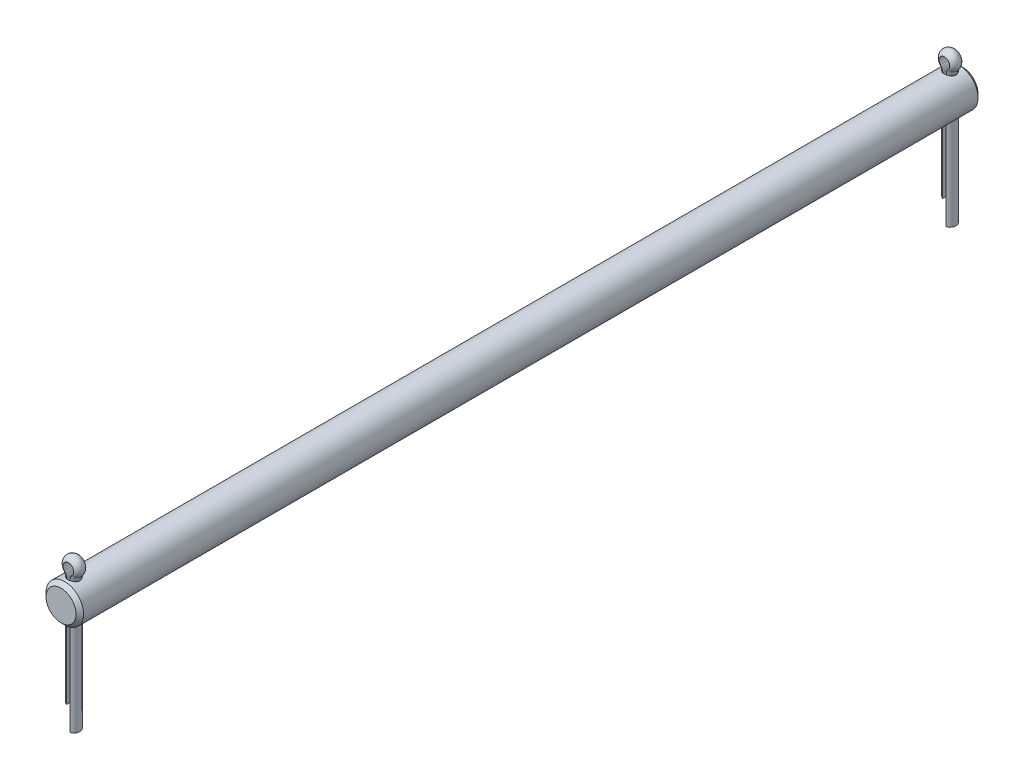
ISO-10303-21;
HEADER;
FILE_DESCRIPTION(('STEP AP214'),'2;1');
FILE_NAME('part.step','',(''),(''),'','','');
FILE_SCHEMA(('AUTOMOTIVE_DESIGN { 1 0 10303 214 1 1 1 1 }'));
ENDSEC;
DATA;
#1=APPLICATION_CONTEXT('core data for automotive mechanical design processes');
#2=APPLICATION_PROTOCOL_DEFINITION('international standard','automotive_design',2000,#1);
#3=PRODUCT_CONTEXT('',#1,'mechanical');
#4=PRODUCT('Part','Part','',(#3));
#5=PRODUCT_RELATED_PRODUCT_CATEGORY('part','',(#4));
#6=PRODUCT_DEFINITION_FORMATION('','',#4);
#7=PRODUCT_DEFINITION_CONTEXT('part definition',#1,'design');
#8=PRODUCT_DEFINITION('design','',#6,#7);
#9=PRODUCT_DEFINITION_SHAPE('','',#8);
#10=(LENGTH_UNIT() NAMED_UNIT(*) SI_UNIT(.MILLI.,.METRE.));
#11=(NAMED_UNIT(*) PLANE_ANGLE_UNIT() SI_UNIT($,.RADIAN.));
#12=(NAMED_UNIT(*) SI_UNIT($,.STERADIAN.) SOLID_ANGLE_UNIT());
#13=UNCERTAINTY_MEASURE_WITH_UNIT(LENGTH_MEASURE(1.E-05),#10,'distance_accuracy_value','');
#14=(GEOMETRIC_REPRESENTATION_CONTEXT(3) GLOBAL_UNCERTAINTY_ASSIGNED_CONTEXT((#13)) GLOBAL_UNIT_ASSIGNED_CONTEXT((#10,
#11,#12)) REPRESENTATION_CONTEXT('',''));
#15=CARTESIAN_POINT('',(0.,0.,0.));
#16=DIRECTION('',(0.,0.,1.));
#17=DIRECTION('',(1.,0.,0.));
#18=AXIS2_PLACEMENT_3D('',#15,#16,#17);
#19=CARTESIAN_POINT('',(-0.595312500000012,6.34999999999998,-149.927348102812));
#20=DIRECTION('',(1.,0.,0.));
#21=DIRECTION('',(0.,0.,1.));
#22=AXIS2_PLACEMENT_3D('',#19,#20,#21);
#23=PLANE('',#22);
#24=DIRECTION('',(0.,0.,-1.));
#25=VECTOR('',#24,1.);
#26=CARTESIAN_POINT('',(-0.595312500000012,6.34999999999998,-149.927348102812));
#27=LINE('',#26,#25);
#28=CARTESIAN_POINT('',(-0.595312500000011,6.34999999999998,-146.141401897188));
#29=VERTEX_POINT('',#28);
#30=CARTESIAN_POINT('',(-0.595312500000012,6.34999999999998,-149.927348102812));
#31=VERTEX_POINT('',#30);
#32=EDGE_CURVE('E157',#29,#31,#27,.T.);
#33=ORIENTED_EDGE('',*,*,#32,.F.);
#34=DIRECTION('',(0.,-1.,0.));
#35=VECTOR('',#34,1.);
#36=CARTESIAN_POINT('',(-0.595312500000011,6.34999999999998,-146.141401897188));
#37=LINE('',#36,#35);
#38=CARTESIAN_POINT('',(-0.595312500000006,-30.5049023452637,-146.141401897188));
#39=VERTEX_POINT('',#38);
#40=EDGE_CURVE('E12',#29,#39,#37,.T.);
#41=ORIENTED_EDGE('',*,*,#40,.T.);
#42=DIRECTION('',(0.,0.,-1.));
#43=VECTOR('',#42,1.);
#44=CARTESIAN_POINT('',(-0.595312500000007,-30.5049023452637,-149.927348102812));
#45=LINE('',#44,#43);
#46=CARTESIAN_POINT('',(-0.595312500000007,-30.5049023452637,-149.927348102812));
#47=VERTEX_POINT('',#46);
#48=EDGE_CURVE('E170',#39,#47,#45,.T.);
#49=ORIENTED_EDGE('',*,*,#48,.T.);
#50=DIRECTION('',(0.,-1.,0.));
#51=VECTOR('',#50,1.);
#52=CARTESIAN_POINT('',(-0.595312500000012,6.34999999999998,-149.927348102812));
#53=LINE('',#52,#51);
#54=EDGE_CURVE('E62',#31,#47,#53,.T.);
#55=ORIENTED_EDGE('',*,*,#54,.F.);
#56=EDGE_LOOP('',(#33,#41,#49,#55));
#57=FACE_BOUND('',#56,.T.);
#58=ADVANCED_FACE('F57',(#57),#23,.T.);
#59=CARTESIAN_POINT('',(0.,6.34999999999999,-148.034375));
#60=DIRECTION('',(0.,-1.,0.));
#61=DIRECTION('',(1.,0.,0.));
#62=AXIS2_PLACEMENT_3D('',#59,#60,#61);
#63=CYLINDRICAL_SURFACE('',#62,1.98437499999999);
#64=CARTESIAN_POINT('',(0.,6.34999999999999,-148.034375));
#65=DIRECTION('',(0.,1.,0.));
#66=DIRECTION('',(1.,0.,0.));
#67=AXIS2_PLACEMENT_3D('',#64,#65,#66);
#68=CIRCLE('',#67,1.98437499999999);
#69=EDGE_CURVE('E156',#31,#29,#68,.T.);
#70=ORIENTED_EDGE('',*,*,#69,.F.);
#71=ORIENTED_EDGE('',*,*,#54,.T.);
#72=CARTESIAN_POINT('',(0.,-30.5049023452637,-148.034375));
#73=DIRECTION('',(0.,1.,0.));
#74=DIRECTION('',(1.,0.,0.));
#75=AXIS2_PLACEMENT_3D('',#72,#73,#74);
#76=CIRCLE('',#75,1.98437499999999);
#77=EDGE_CURVE('E70',#47,#39,#76,.T.);
#78=ORIENTED_EDGE('',*,*,#77,.T.);
#79=ORIENTED_EDGE('',*,*,#40,.F.);
#80=EDGE_LOOP('',(#70,#71,#78,#79));
#81=FACE_BOUND('',#80,.T.);
#82=ADVANCED_FACE('F171',(#81),#63,.T.);
#83=CARTESIAN_POINT('',(-3.571875,6.35,-148.034375));
#84=DIRECTION('',(0.,0.,1.));
#85=DIRECTION('',(-1.,0.,0.));
#86=AXIS2_PLACEMENT_3D('',#83,#84,#85);
#87=CYLINDRICAL_SURFACE('',#86,2.97656249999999);
#88=DIRECTION('',(0.,0.,-1.));
#89=VECTOR('',#88,1.);
#90=CARTESIAN_POINT('',(-1.33945312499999,8.31881103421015,-149.927348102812));
#91=LINE('',#90,#89);
#92=CARTESIAN_POINT('',(-1.33945312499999,8.31881103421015,-146.141401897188));
#93=VERTEX_POINT('',#92);
#94=CARTESIAN_POINT('',(-1.33945312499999,8.31881103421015,-149.927348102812));
#95=VERTEX_POINT('',#94);
#96=EDGE_CURVE('E149',#93,#95,#91,.T.);
#97=ORIENTED_EDGE('',*,*,#96,.F.);
#98=CARTESIAN_POINT('',(-3.571875,6.35,-146.141401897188));
#99=DIRECTION('',(0.,0.,-1.));
#100=DIRECTION('',(-1.,0.,0.));
#101=AXIS2_PLACEMENT_3D('',#98,#99,#100);
#102=CIRCLE('',#101,2.97656249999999);
#103=EDGE_CURVE('E163',#93,#29,#102,.T.);
#104=ORIENTED_EDGE('',*,*,#103,.T.);
#105=ORIENTED_EDGE('',*,*,#32,.T.);
#106=CARTESIAN_POINT('',(-3.571875,6.35,-149.927348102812));
#107=DIRECTION('',(0.,0.,-1.));
#108=DIRECTION('',(-1.,0.,0.));
#109=AXIS2_PLACEMENT_3D('',#106,#107,#108);
#110=CIRCLE('',#109,2.97656249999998);
#111=EDGE_CURVE('E165',#95,#31,#110,.T.);
#112=ORIENTED_EDGE('',*,*,#111,.F.);
#113=EDGE_LOOP('',(#97,#104,#105,#112));
#114=FACE_BOUND('',#113,.T.);
#115=ADVANCED_FACE('F188',(#114),#87,.T.);
#116=CARTESIAN_POINT('',(-3.571875,6.35,-148.034375));
#117=DIRECTION('',(0.,0.,1.));
#118=DIRECTION('',(-1.,0.,0.));
#119=AXIS2_PLACEMENT_3D('',#116,#117,#118);
#120=TOROIDAL_SURFACE('',#119,3.57187499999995,1.98437499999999);
#121=CARTESIAN_POINT('',(-0.892968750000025,8.71257324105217,-148.034375));
#122=DIRECTION('',(-0.66143782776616,0.749999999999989,0.));
#123=DIRECTION('',(0.749999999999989,0.66143782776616,0.));
#124=AXIS2_PLACEMENT_3D('',#121,#122,#123);
#125=CIRCLE('',#124,1.98437499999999);
#126=EDGE_CURVE('E132',#95,#93,#125,.T.);
#127=ORIENTED_EDGE('',*,*,#126,.F.);
#128=ORIENTED_EDGE('',*,*,#111,.T.);
#129=ORIENTED_EDGE('',*,*,#69,.T.);
#130=ORIENTED_EDGE('',*,*,#103,.F.);
#131=EDGE_LOOP('',(#127,#128,#129,#130));
#132=FACE_BOUND('',#131,.T.);
#133=ADVANCED_FACE('F194',(#132),#120,.T.);
#134=CARTESIAN_POINT('',(0.,9.50009765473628,-148.034375));
#135=DIRECTION('',(0.,0.,-1.));
#136=DIRECTION('',(1.,0.,0.));
#137=AXIS2_PLACEMENT_3D('',#134,#135,#136);
#138=CYLINDRICAL_SURFACE('',#137,1.78593750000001);
#139=DIRECTION('',(0.,0.,-1.));
#140=VECTOR('',#139,1.);
#141=CARTESIAN_POINT('',(1.33945312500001,8.31881103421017,-149.927348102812));
#142=LINE('',#141,#140);
#143=CARTESIAN_POINT('',(1.33945312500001,8.31881103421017,-146.141401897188));
#144=VERTEX_POINT('',#143);
#145=CARTESIAN_POINT('',(1.33945312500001,8.31881103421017,-149.927348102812));
#146=VERTEX_POINT('',#145);
#147=EDGE_CURVE('E145',#144,#146,#142,.T.);
#148=ORIENTED_EDGE('',*,*,#147,.F.);
#149=CARTESIAN_POINT('',(0.,9.50009765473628,-146.141401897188));
#150=DIRECTION('',(0.,0.,1.));
#151=DIRECTION('',(1.,0.,0.));
#152=AXIS2_PLACEMENT_3D('',#149,#150,#151);
#153=CIRCLE('',#152,1.78593750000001);
#154=EDGE_CURVE('E152',#144,#93,#153,.T.);
#155=ORIENTED_EDGE('',*,*,#154,.T.);
#156=ORIENTED_EDGE('',*,*,#96,.T.);
#157=CARTESIAN_POINT('',(0.,9.50009765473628,-149.927348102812));
#158=DIRECTION('',(0.,0.,1.));
#159=DIRECTION('',(1.,0.,0.));
#160=AXIS2_PLACEMENT_3D('',#157,#158,#159);
#161=CIRCLE('',#160,1.78593750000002);
#162=EDGE_CURVE('E155',#146,#95,#161,.T.);
#163=ORIENTED_EDGE('',*,*,#162,.F.);
#164=EDGE_LOOP('',(#148,#155,#156,#163));
#165=FACE_BOUND('',#164,.T.);
#166=ADVANCED_FACE('F200',(#165),#138,.F.);
#167=CARTESIAN_POINT('',(0.,9.50009765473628,-148.034375));
#168=DIRECTION('',(0.,0.,-1.));
#169=DIRECTION('',(1.,0.,0.));
#170=AXIS2_PLACEMENT_3D('',#167,#168,#169);
#171=DEGENERATE_TOROIDAL_SURFACE('',#170,1.19062500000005,1.98437499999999,.T.);
#172=CARTESIAN_POINT('',(0.892968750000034,8.71257324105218,-148.034375));
#173=DIRECTION('',(-0.661437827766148,-0.75,0.));
#174=DIRECTION('',(-0.75,0.661437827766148,0.));
#175=AXIS2_PLACEMENT_3D('',#172,#173,#174);
#176=CIRCLE('',#175,1.98437499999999);
#177=EDGE_CURVE('E116',#146,#144,#176,.T.);
#178=ORIENTED_EDGE('',*,*,#177,.F.);
#179=ORIENTED_EDGE('',*,*,#162,.T.);
#180=ORIENTED_EDGE('',*,*,#126,.T.);
#181=ORIENTED_EDGE('',*,*,#154,.F.);
#182=EDGE_LOOP('',(#178,#179,#180,#181));
#183=FACE_BOUND('',#182,.T.);
#184=ADVANCED_FACE('F201',(#183),#171,.T.);
#185=CARTESIAN_POINT('',(3.571875,6.35,-148.034375));
#186=DIRECTION('',(0.,0.,1.));
#187=DIRECTION('',(-1.,0.,0.));
#188=AXIS2_PLACEMENT_3D('',#185,#186,#187);
#189=CYLINDRICAL_SURFACE('',#188,2.97656249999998);
#190=DIRECTION('',(0.,0.,-1.));
#191=VECTOR('',#190,1.);
#192=CARTESIAN_POINT('',(0.595312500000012,6.35,-149.927348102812));
#193=LINE('',#192,#191);
#194=CARTESIAN_POINT('',(0.595312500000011,6.35,-146.141401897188));
#195=VERTEX_POINT('',#194);
#196=CARTESIAN_POINT('',(0.595312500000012,6.35,-149.927348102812));
#197=VERTEX_POINT('',#196);
#198=EDGE_CURVE('E112',#195,#197,#193,.T.);
#199=ORIENTED_EDGE('',*,*,#198,.F.);
#200=CARTESIAN_POINT('',(3.571875,6.35,-146.141401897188));
#201=DIRECTION('',(0.,0.,-1.));
#202=DIRECTION('',(-1.,0.,0.));
#203=AXIS2_PLACEMENT_3D('',#200,#201,#202);
#204=CIRCLE('',#203,2.97656249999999);
#205=EDGE_CURVE('E130',#195,#144,#204,.T.);
#206=ORIENTED_EDGE('',*,*,#205,.T.);
#207=ORIENTED_EDGE('',*,*,#147,.T.);
#208=CARTESIAN_POINT('',(3.571875,6.35,-149.927348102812));
#209=DIRECTION('',(0.,0.,-1.));
#210=DIRECTION('',(-1.,0.,0.));
#211=AXIS2_PLACEMENT_3D('',#208,#209,#210);
#212=CIRCLE('',#211,2.97656249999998);
#213=EDGE_CURVE('E133',#197,#146,#212,.T.);
#214=ORIENTED_EDGE('',*,*,#213,.F.);
#215=EDGE_LOOP('',(#199,#206,#207,#214));
#216=FACE_BOUND('',#215,.T.);
#217=ADVANCED_FACE('F136',(#216),#189,.T.);
#218=CARTESIAN_POINT('',(3.571875,6.35,-148.034375));
#219=DIRECTION('',(0.,0.,1.));
#220=DIRECTION('',(-1.,0.,0.));
#221=AXIS2_PLACEMENT_3D('',#218,#219,#220);
#222=TOROIDAL_SURFACE('',#221,3.57187499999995,1.98437499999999);
#223=CARTESIAN_POINT('',(0.,6.35,-148.034375));
#224=DIRECTION('',(0.,-1.,0.));
#225=DIRECTION('',(-1.,0.,0.));
#226=AXIS2_PLACEMENT_3D('',#223,#224,#225);
#227=CIRCLE('',#226,1.98437499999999);
#228=EDGE_CURVE('E119',#197,#195,#227,.T.);
#229=ORIENTED_EDGE('',*,*,#228,.F.);
#230=ORIENTED_EDGE('',*,*,#213,.T.);
#231=ORIENTED_EDGE('',*,*,#177,.T.);
#232=ORIENTED_EDGE('',*,*,#205,.F.);
#233=EDGE_LOOP('',(#229,#230,#231,#232));
#234=FACE_BOUND('',#233,.T.);
#235=ADVANCED_FACE('F126',(#234),#222,.T.);
#236=CARTESIAN_POINT('',(0.,6.35,-148.034375));
#237=DIRECTION('',(0.,-1.,0.));
#238=DIRECTION('',(1.,0.,0.));
#239=AXIS2_PLACEMENT_3D('',#236,#237,#238);
#240=CYLINDRICAL_SURFACE('',#239,1.98437499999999);
#241=CARTESIAN_POINT('',(0.,-38.1249023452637,-148.034375));
#242=DIRECTION('',(0.,-1.,0.));
#243=DIRECTION('',(-1.,0.,0.));
#244=AXIS2_PLACEMENT_3D('',#241,#242,#243);
#245=CIRCLE('',#244,1.98437499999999);
#246=CARTESIAN_POINT('',(0.595312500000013,-38.1249023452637,-149.927348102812));
#247=VERTEX_POINT('',#246);
#248=CARTESIAN_POINT('',(0.595312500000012,-38.1249023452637,-146.141401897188));
#249=VERTEX_POINT('',#248);
#250=EDGE_CURVE('E140',#247,#249,#245,.T.);
#251=ORIENTED_EDGE('',*,*,#250,.F.);
#252=DIRECTION('',(0.,-1.,0.));
#253=VECTOR('',#252,1.);
#254=CARTESIAN_POINT('',(0.595312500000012,6.35,-149.927348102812));
#255=LINE('',#254,#253);
#256=EDGE_CURVE('E120',#197,#247,#255,.T.);
#257=ORIENTED_EDGE('',*,*,#256,.F.);
#258=ORIENTED_EDGE('',*,*,#228,.T.);
#259=DIRECTION('',(0.,-1.,0.));
#260=VECTOR('',#259,1.);
#261=CARTESIAN_POINT('',(0.595312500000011,6.35,-146.141401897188));
#262=LINE('',#261,#260);
#263=EDGE_CURVE('E106',#195,#249,#262,.T.);
#264=ORIENTED_EDGE('',*,*,#263,.T.);
#265=EDGE_LOOP('',(#251,#257,#258,#264));
#266=FACE_BOUND('',#265,.T.);
#267=ADVANCED_FACE('F122',(#266),#240,.T.);
#268=CARTESIAN_POINT('',(0.595312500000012,6.35,-149.927348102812));
#269=DIRECTION('',(1.,0.,0.));
#270=DIRECTION('',(0.,0.,1.));
#271=AXIS2_PLACEMENT_3D('',#268,#269,#270);
#272=PLANE('',#271);
#273=DIRECTION('',(0.,0.,-1.));
#274=VECTOR('',#273,1.);
#275=CARTESIAN_POINT('',(0.595312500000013,-38.1249023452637,-149.927348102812));
#276=LINE('',#275,#274);
#277=EDGE_CURVE('E115',#249,#247,#276,.T.);
#278=ORIENTED_EDGE('',*,*,#277,.F.);
#279=ORIENTED_EDGE('',*,*,#263,.F.);
#280=ORIENTED_EDGE('',*,*,#198,.T.);
#281=ORIENTED_EDGE('',*,*,#256,.T.);
#282=EDGE_LOOP('',(#278,#279,#280,#281));
#283=FACE_BOUND('',#282,.T.);
#284=ADVANCED_FACE('F107',(#283),#272,.F.);
#285=CARTESIAN_POINT('',(0.,-30.5049023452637,-148.034375));
#286=DIRECTION('',(0.,-1.,0.));
#287=DIRECTION('',(1.,0.,0.));
#288=AXIS2_PLACEMENT_3D('',#285,#286,#287);
#289=PLANE('',#288);
#290=ORIENTED_EDGE('',*,*,#77,.F.);
#291=ORIENTED_EDGE('',*,*,#48,.F.);
#292=EDGE_LOOP('',(#290,#291));
#293=FACE_BOUND('',#292,.T.);
#294=ADVANCED_FACE('F173',(#293),#289,.T.);
#295=CARTESIAN_POINT('',(0.,-38.1249023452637,-148.034375));
#296=DIRECTION('',(0.,1.,0.));
#297=DIRECTION('',(-1.,0.,0.));
#298=AXIS2_PLACEMENT_3D('',#295,#296,#297);
#299=PLANE('',#298);
#300=ORIENTED_EDGE('',*,*,#250,.T.);
#301=ORIENTED_EDGE('',*,*,#277,.T.);
#302=EDGE_LOOP('',(#300,#301));
#303=FACE_BOUND('',#302,.T.);
#304=ADVANCED_FACE('F176',(#303),#299,.F.);
#305=CLOSED_SHELL('',(#58,#82,#115,#133,#166,#184,#217,#235,#267,#284,#294,#304));
#306=MANIFOLD_SOLID_BREP('B2',#305);
#307=CARTESIAN_POINT('',(-0.595312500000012,6.34999999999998,149.927348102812));
#308=DIRECTION('',(1.,0.,0.));
#309=DIRECTION('',(0.,0.,-1.));
#310=AXIS2_PLACEMENT_3D('',#307,#308,#309);
#311=PLANE('',#310);
#312=DIRECTION('',(0.,0.,1.));
#313=VECTOR('',#312,1.);
#314=CARTESIAN_POINT('',(-0.595312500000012,6.34999999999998,149.927348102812));
#315=LINE('',#314,#313);
#316=CARTESIAN_POINT('',(-0.595312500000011,6.34999999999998,146.141401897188));
#317=VERTEX_POINT('',#316);
#318=CARTESIAN_POINT('',(-0.595312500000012,6.34999999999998,149.927348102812));
#319=VERTEX_POINT('',#318);
#320=EDGE_CURVE('E405',#317,#319,#315,.T.);
#321=ORIENTED_EDGE('',*,*,#320,.T.);
#322=DIRECTION('',(0.,-1.,0.));
#323=VECTOR('',#322,1.);
#324=CARTESIAN_POINT('',(-0.595312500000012,6.34999999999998,149.927348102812));
#325=LINE('',#324,#323);
#326=CARTESIAN_POINT('',(-0.595312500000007,-30.5049023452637,149.927348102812));
#327=VERTEX_POINT('',#326);
#328=EDGE_CURVE('E302',#319,#327,#325,.T.);
#329=ORIENTED_EDGE('',*,*,#328,.T.);
#330=DIRECTION('',(0.,0.,1.));
#331=VECTOR('',#330,1.);
#332=CARTESIAN_POINT('',(-0.595312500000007,-30.5049023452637,149.927348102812));
#333=LINE('',#332,#331);
#334=CARTESIAN_POINT('',(-0.595312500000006,-30.5049023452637,146.141401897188));
#335=VERTEX_POINT('',#334);
#336=EDGE_CURVE('E310',#335,#327,#333,.T.);
#337=ORIENTED_EDGE('',*,*,#336,.F.);
#338=DIRECTION('',(0.,-1.,0.));
#339=VECTOR('',#338,1.);
#340=CARTESIAN_POINT('',(-0.595312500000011,6.34999999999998,146.141401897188));
#341=LINE('',#340,#339);
#342=EDGE_CURVE('E53',#317,#335,#341,.T.);
#343=ORIENTED_EDGE('',*,*,#342,.F.);
#344=EDGE_LOOP('',(#321,#329,#337,#343));
#345=FACE_BOUND('',#344,.T.);
#346=ADVANCED_FACE('F293',(#345),#311,.T.);
#347=CARTESIAN_POINT('',(0.,6.34999999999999,148.034375));
#348=DIRECTION('',(0.,-1.,0.));
#349=DIRECTION('',(1.,0.,0.));
#350=AXIS2_PLACEMENT_3D('',#347,#348,#349);
#351=CYLINDRICAL_SURFACE('',#350,1.98437499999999);
#352=CARTESIAN_POINT('',(0.,6.34999999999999,148.034375));
#353=DIRECTION('',(0.,-1.,0.));
#354=DIRECTION('',(1.,0.,0.));
#355=AXIS2_PLACEMENT_3D('',#352,#353,#354);
#356=CIRCLE('',#355,1.98437499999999);
#357=EDGE_CURVE('E398',#319,#317,#356,.T.);
#358=ORIENTED_EDGE('',*,*,#357,.T.);
#359=ORIENTED_EDGE('',*,*,#342,.T.);
#360=CARTESIAN_POINT('',(0.,-30.5049023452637,148.034375));
#361=DIRECTION('',(0.,-1.,0.));
#362=DIRECTION('',(1.,0.,0.));
#363=AXIS2_PLACEMENT_3D('',#360,#361,#362);
#364=CIRCLE('',#363,1.98437499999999);
#365=EDGE_CURVE('E312',#327,#335,#364,.T.);
#366=ORIENTED_EDGE('',*,*,#365,.F.);
#367=ORIENTED_EDGE('',*,*,#328,.F.);
#368=EDGE_LOOP('',(#358,#359,#366,#367));
#369=FACE_BOUND('',#368,.T.);
#370=ADVANCED_FACE('F413',(#369),#351,.T.);
#371=CARTESIAN_POINT('',(-3.571875,6.35,148.034375));
#372=DIRECTION('',(0.,0.,-1.));
#373=DIRECTION('',(-1.,0.,0.));
#374=AXIS2_PLACEMENT_3D('',#371,#372,#373);
#375=CYLINDRICAL_SURFACE('',#374,2.97656249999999);
#376=DIRECTION('',(0.,0.,1.));
#377=VECTOR('',#376,1.);
#378=CARTESIAN_POINT('',(-1.33945312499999,8.31881103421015,149.927348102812));
#379=LINE('',#378,#377);
#380=CARTESIAN_POINT('',(-1.33945312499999,8.31881103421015,146.141401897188));
#381=VERTEX_POINT('',#380);
#382=CARTESIAN_POINT('',(-1.33945312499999,8.31881103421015,149.927348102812));
#383=VERTEX_POINT('',#382);
#384=EDGE_CURVE('E388',#381,#383,#379,.T.);
#385=ORIENTED_EDGE('',*,*,#384,.T.);
#386=CARTESIAN_POINT('',(-3.571875,6.35,149.927348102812));
#387=DIRECTION('',(0.,0.,-1.));
#388=DIRECTION('',(-1.,0.,0.));
#389=AXIS2_PLACEMENT_3D('',#386,#387,#388);
#390=CIRCLE('',#389,2.97656249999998);
#391=EDGE_CURVE('E403',#383,#319,#390,.T.);
#392=ORIENTED_EDGE('',*,*,#391,.T.);
#393=ORIENTED_EDGE('',*,*,#320,.F.);
#394=CARTESIAN_POINT('',(-3.571875,6.35,146.141401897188));
#395=DIRECTION('',(0.,0.,-1.));
#396=DIRECTION('',(-1.,0.,0.));
#397=AXIS2_PLACEMENT_3D('',#394,#395,#396);
#398=CIRCLE('',#397,2.97656249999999);
#399=EDGE_CURVE('E407',#381,#317,#398,.T.);
#400=ORIENTED_EDGE('',*,*,#399,.F.);
#401=EDGE_LOOP('',(#385,#392,#393,#400));
#402=FACE_BOUND('',#401,.T.);
#403=ADVANCED_FACE('F417',(#402),#375,.T.);
#404=CARTESIAN_POINT('',(-3.571875,6.35,148.034375));
#405=DIRECTION('',(0.,0.,-1.));
#406=DIRECTION('',(-1.,0.,0.));
#407=AXIS2_PLACEMENT_3D('',#404,#405,#406);
#408=TOROIDAL_SURFACE('',#407,3.57187499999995,1.98437499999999);
#409=CARTESIAN_POINT('',(-0.892968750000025,8.71257324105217,148.034375));
#410=DIRECTION('',(0.66143782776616,-0.749999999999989,0.));
#411=DIRECTION('',(0.749999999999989,0.66143782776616,0.));
#412=AXIS2_PLACEMENT_3D('',#409,#410,#411);
#413=CIRCLE('',#412,1.98437499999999);
#414=EDGE_CURVE('E359',#383,#381,#413,.T.);
#415=ORIENTED_EDGE('',*,*,#414,.T.);
#416=ORIENTED_EDGE('',*,*,#399,.T.);
#417=ORIENTED_EDGE('',*,*,#357,.F.);
#418=ORIENTED_EDGE('',*,*,#391,.F.);
#419=EDGE_LOOP('',(#415,#416,#417,#418));
#420=FACE_BOUND('',#419,.T.);
#421=ADVANCED_FACE('F416',(#420),#408,.T.);
#422=CARTESIAN_POINT('',(0.,9.50009765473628,148.034375));
#423=DIRECTION('',(0.,0.,1.));
#424=DIRECTION('',(1.,0.,0.));
#425=AXIS2_PLACEMENT_3D('',#422,#423,#424);
#426=CYLINDRICAL_SURFACE('',#425,1.78593750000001);
#427=DIRECTION('',(0.,0.,1.));
#428=VECTOR('',#427,1.);
#429=CARTESIAN_POINT('',(1.33945312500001,8.31881103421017,149.927348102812));
#430=LINE('',#429,#428);
#431=CARTESIAN_POINT('',(1.33945312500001,8.31881103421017,146.141401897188));
#432=VERTEX_POINT('',#431);
#433=CARTESIAN_POINT('',(1.33945312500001,8.31881103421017,149.927348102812));
#434=VERTEX_POINT('',#433);
#435=EDGE_CURVE('E354',#432,#434,#430,.T.);
#436=ORIENTED_EDGE('',*,*,#435,.T.);
#437=CARTESIAN_POINT('',(0.,9.50009765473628,149.927348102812));
#438=DIRECTION('',(0.,0.,1.));
#439=DIRECTION('',(1.,0.,0.));
#440=AXIS2_PLACEMENT_3D('',#437,#438,#439);
#441=CIRCLE('',#440,1.78593750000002);
#442=EDGE_CURVE('E392',#434,#383,#441,.T.);
#443=ORIENTED_EDGE('',*,*,#442,.T.);
#444=ORIENTED_EDGE('',*,*,#384,.F.);
#445=CARTESIAN_POINT('',(0.,9.50009765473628,146.141401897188));
#446=DIRECTION('',(0.,0.,1.));
#447=DIRECTION('',(1.,0.,0.));
#448=AXIS2_PLACEMENT_3D('',#445,#446,#447);
#449=CIRCLE('',#448,1.78593750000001);
#450=EDGE_CURVE('E396',#432,#381,#449,.T.);
#451=ORIENTED_EDGE('',*,*,#450,.F.);
#452=EDGE_LOOP('',(#436,#443,#444,#451));
#453=FACE_BOUND('',#452,.T.);
#454=ADVANCED_FACE('F421',(#453),#426,.F.);
#455=CARTESIAN_POINT('',(0.,9.50009765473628,148.034375));
#456=DIRECTION('',(0.,0.,1.));
#457=DIRECTION('',(1.,0.,0.));
#458=AXIS2_PLACEMENT_3D('',#455,#456,#457);
#459=DEGENERATE_TOROIDAL_SURFACE('',#458,1.19062500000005,1.98437499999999,.T.);
#460=CARTESIAN_POINT('',(0.892968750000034,8.71257324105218,148.034375));
#461=DIRECTION('',(0.661437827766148,0.75,0.));
#462=DIRECTION('',(-0.75,0.661437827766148,0.));
#463=AXIS2_PLACEMENT_3D('',#460,#461,#462);
#464=CIRCLE('',#463,1.98437499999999);
#465=EDGE_CURVE('E377',#434,#432,#464,.T.);
#466=ORIENTED_EDGE('',*,*,#465,.T.);
#467=ORIENTED_EDGE('',*,*,#450,.T.);
#468=ORIENTED_EDGE('',*,*,#414,.F.);
#469=ORIENTED_EDGE('',*,*,#442,.F.);
#470=EDGE_LOOP('',(#466,#467,#468,#469));
#471=FACE_BOUND('',#470,.T.);
#472=ADVANCED_FACE('F424',(#471),#459,.T.);
#473=CARTESIAN_POINT('',(3.571875,6.35,148.034375));
#474=DIRECTION('',(0.,0.,-1.));
#475=DIRECTION('',(-1.,0.,0.));
#476=AXIS2_PLACEMENT_3D('',#473,#474,#475);
#477=CYLINDRICAL_SURFACE('',#476,2.97656249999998);
#478=DIRECTION('',(0.,0.,1.));
#479=VECTOR('',#478,1.);
#480=CARTESIAN_POINT('',(0.595312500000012,6.35,149.927348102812));
#481=LINE('',#480,#479);
#482=CARTESIAN_POINT('',(0.595312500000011,6.35,146.141401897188));
#483=VERTEX_POINT('',#482);
#484=CARTESIAN_POINT('',(0.595312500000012,6.35,149.927348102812));
#485=VERTEX_POINT('',#484);
#486=EDGE_CURVE('E355',#483,#485,#481,.T.);
#487=ORIENTED_EDGE('',*,*,#486,.T.);
#488=CARTESIAN_POINT('',(3.571875,6.35,149.927348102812));
#489=DIRECTION('',(0.,0.,-1.));
#490=DIRECTION('',(-1.,0.,0.));
#491=AXIS2_PLACEMENT_3D('',#488,#489,#490);
#492=CIRCLE('',#491,2.97656249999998);
#493=EDGE_CURVE('E358',#485,#434,#492,.T.);
#494=ORIENTED_EDGE('',*,*,#493,.T.);
#495=ORIENTED_EDGE('',*,*,#435,.F.);
#496=CARTESIAN_POINT('',(3.571875,6.35,146.141401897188));
#497=DIRECTION('',(0.,0.,-1.));
#498=DIRECTION('',(-1.,0.,0.));
#499=AXIS2_PLACEMENT_3D('',#496,#497,#498);
#500=CIRCLE('',#499,2.97656249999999);
#501=EDGE_CURVE('E350',#483,#432,#500,.T.);
#502=ORIENTED_EDGE('',*,*,#501,.F.);
#503=EDGE_LOOP('',(#487,#494,#495,#502));
#504=FACE_BOUND('',#503,.T.);
#505=ADVANCED_FACE('F349',(#504),#477,.T.);
#506=CARTESIAN_POINT('',(3.571875,6.35,148.034375));
#507=DIRECTION('',(0.,0.,-1.));
#508=DIRECTION('',(-1.,0.,0.));
#509=AXIS2_PLACEMENT_3D('',#506,#507,#508);
#510=TOROIDAL_SURFACE('',#509,3.57187499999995,1.98437499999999);
#511=CARTESIAN_POINT('',(0.,6.35,148.034375));
#512=DIRECTION('',(0.,1.,0.));
#513=DIRECTION('',(-1.,0.,0.));
#514=AXIS2_PLACEMENT_3D('',#511,#512,#513);
#515=CIRCLE('',#514,1.98437499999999);
#516=EDGE_CURVE('E362',#485,#483,#515,.T.);
#517=ORIENTED_EDGE('',*,*,#516,.T.);
#518=ORIENTED_EDGE('',*,*,#501,.T.);
#519=ORIENTED_EDGE('',*,*,#465,.F.);
#520=ORIENTED_EDGE('',*,*,#493,.F.);
#521=EDGE_LOOP('',(#517,#518,#519,#520));
#522=FACE_BOUND('',#521,.T.);
#523=ADVANCED_FACE('F361',(#522),#510,.T.);
#524=CARTESIAN_POINT('',(0.,6.35,148.034375));
#525=DIRECTION('',(0.,-1.,0.));
#526=DIRECTION('',(1.,0.,0.));
#527=AXIS2_PLACEMENT_3D('',#524,#525,#526);
#528=CYLINDRICAL_SURFACE('',#527,1.98437499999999);
#529=CARTESIAN_POINT('',(0.,-38.1249023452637,148.034375));
#530=DIRECTION('',(0.,1.,0.));
#531=DIRECTION('',(-1.,0.,0.));
#532=AXIS2_PLACEMENT_3D('',#529,#530,#531);
#533=CIRCLE('',#532,1.98437499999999);
#534=CARTESIAN_POINT('',(0.595312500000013,-38.1249023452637,149.927348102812));
#535=VERTEX_POINT('',#534);
#536=CARTESIAN_POINT('',(0.595312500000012,-38.1249023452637,146.141401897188));
#537=VERTEX_POINT('',#536);
#538=EDGE_CURVE('E378',#535,#537,#533,.T.);
#539=ORIENTED_EDGE('',*,*,#538,.T.);
#540=DIRECTION('',(0.,-1.,0.));
#541=VECTOR('',#540,1.);
#542=CARTESIAN_POINT('',(0.595312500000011,6.35,146.141401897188));
#543=LINE('',#542,#541);
#544=EDGE_CURVE('E375',#483,#537,#543,.T.);
#545=ORIENTED_EDGE('',*,*,#544,.F.);
#546=ORIENTED_EDGE('',*,*,#516,.F.);
#547=DIRECTION('',(0.,-1.,0.));
#548=VECTOR('',#547,1.);
#549=CARTESIAN_POINT('',(0.595312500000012,6.35,149.927348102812));
#550=LINE('',#549,#548);
#551=EDGE_CURVE('E372',#485,#535,#550,.T.);
#552=ORIENTED_EDGE('',*,*,#551,.T.);
#553=EDGE_LOOP('',(#539,#545,#546,#552));
#554=FACE_BOUND('',#553,.T.);
#555=ADVANCED_FACE('F376',(#554),#528,.T.);
#556=CARTESIAN_POINT('',(0.595312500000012,6.35,149.927348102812));
#557=DIRECTION('',(1.,0.,0.));
#558=DIRECTION('',(0.,0.,-1.));
#559=AXIS2_PLACEMENT_3D('',#556,#557,#558);
#560=PLANE('',#559);
#561=DIRECTION('',(0.,0.,1.));
#562=VECTOR('',#561,1.);
#563=CARTESIAN_POINT('',(0.595312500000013,-38.1249023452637,149.927348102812));
#564=LINE('',#563,#562);
#565=EDGE_CURVE('E370',#537,#535,#564,.T.);
#566=ORIENTED_EDGE('',*,*,#565,.T.);
#567=ORIENTED_EDGE('',*,*,#551,.F.);
#568=ORIENTED_EDGE('',*,*,#486,.F.);
#569=ORIENTED_EDGE('',*,*,#544,.T.);
#570=EDGE_LOOP('',(#566,#567,#568,#569));
#571=FACE_BOUND('',#570,.T.);
#572=ADVANCED_FACE('F371',(#571),#560,.F.);
#573=CARTESIAN_POINT('',(0.,-30.5049023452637,148.034375));
#574=DIRECTION('',(0.,-1.,0.));
#575=DIRECTION('',(1.,0.,0.));
#576=AXIS2_PLACEMENT_3D('',#573,#574,#575);
#577=PLANE('',#576);
#578=ORIENTED_EDGE('',*,*,#365,.T.);
#579=ORIENTED_EDGE('',*,*,#336,.T.);
#580=EDGE_LOOP('',(#578,#579));
#581=FACE_BOUND('',#580,.T.);
#582=ADVANCED_FACE('F488',(#581),#577,.T.);
#583=CARTESIAN_POINT('',(0.,-38.1249023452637,148.034375));
#584=DIRECTION('',(0.,1.,0.));
#585=DIRECTION('',(-1.,0.,0.));
#586=AXIS2_PLACEMENT_3D('',#583,#584,#585);
#587=PLANE('',#586);
#588=ORIENTED_EDGE('',*,*,#538,.F.);
#589=ORIENTED_EDGE('',*,*,#565,.F.);
#590=EDGE_LOOP('',(#588,#589));
#591=FACE_BOUND('',#590,.T.);
#592=ADVANCED_FACE('F500',(#591),#587,.F.);
#593=CLOSED_SHELL('',(#346,#370,#403,#421,#454,#472,#505,#523,#555,#572,#582,#592));
#594=MANIFOLD_SOLID_BREP('B6',#593);
#595=CARTESIAN_POINT('',(0.,0.,152.4));
#596=DIRECTION('',(0.,0.,-1.));
#597=DIRECTION('',(-1.,0.,0.));
#598=AXIS2_PLACEMENT_3D('',#595,#596,#597);
#599=CYLINDRICAL_SURFACE('',#598,6.35);
#600=CARTESIAN_POINT('',(0.,0.,-151.13));
#601=DIRECTION('',(0.,0.,1.));
#602=DIRECTION('',(1.,0.,0.));
#603=AXIS2_PLACEMENT_3D('',#600,#601,#602);
#604=CIRCLE('',#603,6.35);
#605=CARTESIAN_POINT('',(6.35,0.,-151.13));
#606=VERTEX_POINT('',#605);
#607=EDGE_CURVE('E538',#606,#606,#604,.T.);
#608=ORIENTED_EDGE('',*,*,#607,.T.);
#609=EDGE_LOOP('',(#608));
#610=FACE_BOUND('',#609,.T.);
#611=CARTESIAN_POINT('',(0.,0.,151.13));
#612=DIRECTION('',(0.,0.,1.));
#613=DIRECTION('',(1.,0.,0.));
#614=AXIS2_PLACEMENT_3D('',#611,#612,#613);
#615=CIRCLE('',#614,6.35);
#616=CARTESIAN_POINT('',(6.35,0.,151.13));
#617=VERTEX_POINT('',#616);
#618=EDGE_CURVE('E545',#617,#617,#615,.F.);
#619=ORIENTED_EDGE('',*,*,#618,.T.);
#620=EDGE_LOOP('',(#619));
#621=FACE_BOUND('',#620,.T.);
#622=CARTESIAN_POINT('',(0.,-6.35,-146.05));
#623=CARTESIAN_POINT('',(0.10864720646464,-6.34999945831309,-146.050000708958));
#624=CARTESIAN_POINT('',(0.217301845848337,-6.34718528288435,-146.058952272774));
#625=CARTESIAN_POINT('',(0.431433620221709,-6.3362346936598,-146.094428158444));
#626=CARTESIAN_POINT('',(0.536910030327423,-6.32809707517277,-146.120956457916));
#627=CARTESIAN_POINT('',(0.741566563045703,-6.30738857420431,-146.190603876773));
#628=CARTESIAN_POINT('',(0.840756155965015,-6.29482455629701,-146.233697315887));
#629=CARTESIAN_POINT('',(1.03050149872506,-6.26656051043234,-146.335142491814));
#630=CARTESIAN_POINT('',(1.12105588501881,-6.25085998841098,-146.393496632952));
#631=CARTESIAN_POINT('',(1.29375746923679,-6.21744714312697,-146.525703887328));
#632=CARTESIAN_POINT('',(1.37560054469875,-6.19969099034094,-146.599943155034));
#633=CARTESIAN_POINT('',(1.52590084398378,-6.16442198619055,-146.760991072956));
#634=CARTESIAN_POINT('',(1.59435557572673,-6.14690918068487,-146.847802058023));
#635=CARTESIAN_POINT('',(1.71758509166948,-6.11363942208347,-147.034161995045));
#636=CARTESIAN_POINT('',(1.77197994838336,-6.09793656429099,-147.133972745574));
#637=CARTESIAN_POINT('',(1.86308588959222,-6.07072385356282,-147.341895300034));
#638=CARTESIAN_POINT('',(1.89980163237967,-6.05921289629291,-147.450004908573));
#639=CARTESIAN_POINT('',(1.95339430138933,-6.04214576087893,-147.668024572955));
#640=CARTESIAN_POINT('',(1.9708353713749,-6.03642069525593,-147.777782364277));
#641=CARTESIAN_POINT('',(1.98714606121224,-6.03107212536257,-147.998804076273));
#642=CARTESIAN_POINT('',(1.98602061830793,-6.03144699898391,-148.110067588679));
#643=CARTESIAN_POINT('',(1.96567146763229,-6.03810687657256,-148.326275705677));
#644=CARTESIAN_POINT('',(1.94716491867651,-6.04415767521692,-148.431296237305));
#645=CARTESIAN_POINT('',(1.89374166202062,-6.06110715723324,-148.636660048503));
#646=CARTESIAN_POINT('',(1.8588232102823,-6.07200635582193,-148.737002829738));
#647=CARTESIAN_POINT('',(1.77306088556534,-6.09760407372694,-148.931871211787));
#648=CARTESIAN_POINT('',(1.72199181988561,-6.11235576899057,-149.026290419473));
#649=CARTESIAN_POINT('',(1.6055343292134,-6.14397197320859,-149.205454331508));
#650=CARTESIAN_POINT('',(1.5401421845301,-6.16083703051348,-149.290196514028));
#651=CARTESIAN_POINT('',(1.39337566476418,-6.19571925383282,-149.451655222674));
#652=CARTESIAN_POINT('',(1.31140925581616,-6.21375391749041,-149.527830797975));
#653=CARTESIAN_POINT('',(1.13564099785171,-6.24826618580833,-149.665486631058));
#654=CARTESIAN_POINT('',(1.04183827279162,-6.26474367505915,-149.726965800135));
#655=CARTESIAN_POINT('',(0.844017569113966,-6.29445805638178,-149.833850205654));
#656=CARTESIAN_POINT('',(0.73992566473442,-6.30766868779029,-149.879126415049));
#657=CARTESIAN_POINT('',(0.525094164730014,-6.32917129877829,-149.951365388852));
#658=CARTESIAN_POINT('',(0.414356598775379,-6.33746477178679,-149.978333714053));
#659=CARTESIAN_POINT('',(0.193968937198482,-6.34795830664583,-150.012269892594));
#660=CARTESIAN_POINT('',(0.0844420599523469,-6.35038136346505,-150.019970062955));
#661=CARTESIAN_POINT('',(-0.134350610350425,-6.34952057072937,-150.017216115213));
#662=CARTESIAN_POINT('',(-0.24361643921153,-6.34623755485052,-150.006764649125));
#663=CARTESIAN_POINT('',(-0.455960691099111,-6.33448002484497,-149.968591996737));
#664=CARTESIAN_POINT('',(-0.559125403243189,-6.32613659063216,-149.941306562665));
#665=CARTESIAN_POINT('',(-0.759383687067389,-6.30523442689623,-149.870772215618));
#666=CARTESIAN_POINT('',(-0.856476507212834,-6.29267517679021,-149.82752133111));
#667=CARTESIAN_POINT('',(-1.04446769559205,-6.26425186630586,-149.725105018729));
#668=CARTESIAN_POINT('',(-1.13515733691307,-6.24831470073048,-149.665577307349));
#669=CARTESIAN_POINT('',(-1.30550578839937,-6.21495788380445,-149.532731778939));
#670=CARTESIAN_POINT('',(-1.38516159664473,-6.19753783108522,-149.45941022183));
#671=CARTESIAN_POINT('',(-1.5344575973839,-6.16230979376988,-149.297614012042));
#672=CARTESIAN_POINT('',(-1.60357585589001,-6.14451378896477,-149.208654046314));
#673=CARTESIAN_POINT('',(-1.72594984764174,-6.11127091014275,-149.020011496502));
#674=CARTESIAN_POINT('',(-1.77920583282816,-6.09582399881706,-148.920329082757));
#675=CARTESIAN_POINT('',(-1.86801257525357,-6.06919954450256,-148.713277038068));
#676=CARTESIAN_POINT('',(-1.90363188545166,-6.05800551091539,-148.605939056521));
#677=CARTESIAN_POINT('',(-1.95616344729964,-6.04124983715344,-148.386367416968));
#678=CARTESIAN_POINT('',(-1.97308281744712,-6.035686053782,-148.274135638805));
#679=CARTESIAN_POINT('',(-1.9872230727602,-6.03104414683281,-148.053418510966));
#680=CARTESIAN_POINT('',(-1.98530018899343,-6.03168409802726,-147.944993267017));
#681=CARTESIAN_POINT('',(-1.9638774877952,-6.03869268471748,-147.730091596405));
#682=CARTESIAN_POINT('',(-1.94437849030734,-6.04506105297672,-147.623615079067));
#683=CARTESIAN_POINT('',(-1.88893021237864,-6.06261192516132,-147.417164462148));
#684=CARTESIAN_POINT('',(-1.85322594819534,-6.07372258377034,-147.317117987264));
#685=CARTESIAN_POINT('',(-1.76657360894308,-6.09948780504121,-147.124355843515));
#686=CARTESIAN_POINT('',(-1.71562243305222,-6.11414308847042,-147.031641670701));
#687=CARTESIAN_POINT('',(-1.59759134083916,-6.14606160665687,-146.852249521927));
#688=CARTESIAN_POINT('',(-1.52995841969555,-6.16340443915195,-146.765949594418));
#689=CARTESIAN_POINT('',(-1.38145678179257,-6.19837785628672,-146.605646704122));
#690=CARTESIAN_POINT('',(-1.30058452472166,-6.21600851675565,-146.531647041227));
#691=CARTESIAN_POINT('',(-1.12472257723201,-6.25026169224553,-146.395626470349));
#692=CARTESIAN_POINT('',(-1.02935813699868,-6.26683248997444,-146.334075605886));
#693=CARTESIAN_POINT('',(-0.829118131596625,-6.29644996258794,-146.227960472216));
#694=CARTESIAN_POINT('',(-0.724246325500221,-6.30949802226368,-146.18338952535));
#695=CARTESIAN_POINT('',(-0.517124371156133,-6.32969033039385,-146.115736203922));
#696=CARTESIAN_POINT('',(-0.415401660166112,-6.3372403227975,-146.091156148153));
#697=CARTESIAN_POINT('',(-0.209121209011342,-6.34739491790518,-146.058289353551));
#698=CARTESIAN_POINT('',(-0.104564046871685,-6.35000052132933,-146.049999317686));
#699=CARTESIAN_POINT('',(0.,-6.35,-146.05));
#700=B_SPLINE_CURVE_WITH_KNOTS('',3,(#622,#623,#624,#625,#626,#627,#628,#629,#630,#631,#632,
#633,#634,#635,#636,#637,#638,#639,#640,#641,#642,#643,#644,#645,#646,#647,#648,#649,#650,#651,
#652,#653,#654,#655,#656,#657,#658,#659,#660,#661,#662,#663,#664,#665,#666,#667,#668,#669,#670,
#671,#672,#673,#674,#675,#676,#677,#678,#679,#680,#681,#682,#683,#684,#685,#686,#687,#688,#689,
#690,#691,#692,#693,#694,#695,#696,#697,#698,#699),.UNSPECIFIED.,.T.,.F.,(4,2,2,2,2,2,2,2,2,2,2,
2,2,2,2,2,2,2,2,2,2,2,2,2,2,2,2,2,2,2,2,2,2,2,2,2,2,2,4),(0.,0.32555727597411,0.651188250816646,
0.976316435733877,1.30149587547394,1.63572542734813,1.97001713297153,2.31257111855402,
2.65503479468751,2.98718525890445,3.3192473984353,3.63818356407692,3.95715362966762,
4.28078332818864,4.60449717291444,4.94294711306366,5.28142211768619,5.6225354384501,
5.96354510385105,6.29138265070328,6.61917230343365,6.93881369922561,7.2584945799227,
7.58596915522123,7.91353265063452,8.25407573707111,8.59461341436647,8.93381683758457,
9.27289109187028,9.59663123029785,9.92035626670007,10.2393418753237,10.5583924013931,
10.8899247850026,11.2215459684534,11.5639956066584,11.9063104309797,12.2196961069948,
12.533018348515),.UNSPECIFIED.);
#701=CARTESIAN_POINT('',(0.,-6.35,-146.05));
#702=VERTEX_POINT('',#701);
#703=EDGE_CURVE('E550',#702,#702,#700,.T.);
#704=ORIENTED_EDGE('',*,*,#703,.T.);
#705=EDGE_LOOP('',(#704));
#706=FACE_BOUND('',#705,.T.);
#707=CARTESIAN_POINT('',(0.,6.35,-146.05));
#708=CARTESIAN_POINT('',(-0.108647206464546,6.34999945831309,-146.050000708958));
#709=CARTESIAN_POINT('',(-0.217301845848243,6.34718528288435,-146.058952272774));
#710=CARTESIAN_POINT('',(-0.431433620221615,6.33623469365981,-146.094428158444));
#711=CARTESIAN_POINT('',(-0.536910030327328,6.32809707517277,-146.120956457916));
#712=CARTESIAN_POINT('',(-0.741566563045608,6.30738857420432,-146.190603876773));
#713=CARTESIAN_POINT('',(-0.840756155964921,6.29482455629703,-146.233697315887));
#714=CARTESIAN_POINT('',(-1.03050149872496,6.26656051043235,-146.335142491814));
#715=CARTESIAN_POINT('',(-1.12105588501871,6.250859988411,-146.393496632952));
#716=CARTESIAN_POINT('',(-1.2937574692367,6.21744714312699,-146.525703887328));
#717=CARTESIAN_POINT('',(-1.37560054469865,6.19969099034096,-146.599943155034));
#718=CARTESIAN_POINT('',(-1.52590084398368,6.16442198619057,-146.760991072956));
#719=CARTESIAN_POINT('',(-1.59435557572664,6.14690918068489,-146.847802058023));
#720=CARTESIAN_POINT('',(-1.71758509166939,6.11363942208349,-147.034161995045));
#721=CARTESIAN_POINT('',(-1.77197994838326,6.09793656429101,-147.133972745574));
#722=CARTESIAN_POINT('',(-1.86308588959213,6.07072385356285,-147.341895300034));
#723=CARTESIAN_POINT('',(-1.89980163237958,6.05921289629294,-147.450004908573));
#724=CARTESIAN_POINT('',(-1.95339430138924,6.04214576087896,-147.668024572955));
#725=CARTESIAN_POINT('',(-1.97083537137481,6.03642069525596,-147.777782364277));
#726=CARTESIAN_POINT('',(-1.98714606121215,6.0310721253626,-147.998804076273));
#727=CARTESIAN_POINT('',(-1.98602061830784,6.03144699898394,-148.110067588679));
#728=CARTESIAN_POINT('',(-1.9656714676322,6.03810687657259,-148.326275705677));
#729=CARTESIAN_POINT('',(-1.94716491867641,6.04415767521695,-148.431296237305));
#730=CARTESIAN_POINT('',(-1.89374166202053,6.06110715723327,-148.636660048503));
#731=CARTESIAN_POINT('',(-1.85882321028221,6.07200635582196,-148.737002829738));
#732=CARTESIAN_POINT('',(-1.77306088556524,6.09760407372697,-148.931871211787));
#733=CARTESIAN_POINT('',(-1.72199181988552,6.1123557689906,-149.026290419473));
#734=CARTESIAN_POINT('',(-1.60553432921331,6.14397197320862,-149.205454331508));
#735=CARTESIAN_POINT('',(-1.54014218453,6.1608370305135,-149.290196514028));
#736=CARTESIAN_POINT('',(-1.39337566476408,6.19571925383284,-149.451655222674));
#737=CARTESIAN_POINT('',(-1.31140925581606,6.21375391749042,-149.527830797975));
#738=CARTESIAN_POINT('',(-1.13564099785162,6.24826618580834,-149.665486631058));
#739=CARTESIAN_POINT('',(-1.04183827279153,6.26474367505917,-149.726965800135));
#740=CARTESIAN_POINT('',(-0.844017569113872,6.29445805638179,-149.833850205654));
#741=CARTESIAN_POINT('',(-0.739925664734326,6.3076686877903,-149.879126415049));
#742=CARTESIAN_POINT('',(-0.525094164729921,6.3291712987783,-149.951365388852));
#743=CARTESIAN_POINT('',(-0.414356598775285,6.33746477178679,-149.978333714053));
#744=CARTESIAN_POINT('',(-0.193968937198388,6.34795830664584,-150.012269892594));
#745=CARTESIAN_POINT('',(-0.0844420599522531,6.35038136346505,-150.019970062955));
#746=CARTESIAN_POINT('',(0.134350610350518,6.34952057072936,-150.017216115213));
#747=CARTESIAN_POINT('',(0.243616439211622,6.34623755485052,-150.006764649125));
#748=CARTESIAN_POINT('',(0.455960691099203,6.33448002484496,-149.968591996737));
#749=CARTESIAN_POINT('',(0.559125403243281,6.32613659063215,-149.941306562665));
#750=CARTESIAN_POINT('',(0.759383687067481,6.30523442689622,-149.870772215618));
#751=CARTESIAN_POINT('',(0.856476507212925,6.2926751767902,-149.82752133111));
#752=CARTESIAN_POINT('',(1.04446769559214,6.26425186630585,-149.725105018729));
#753=CARTESIAN_POINT('',(1.13515733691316,6.24831470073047,-149.665577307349));
#754=CARTESIAN_POINT('',(1.30550578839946,6.21495788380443,-149.532731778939));
#755=CARTESIAN_POINT('',(1.38516159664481,6.1975378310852,-149.45941022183));
#756=CARTESIAN_POINT('',(1.53445759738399,6.16230979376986,-149.297614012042));
#757=CARTESIAN_POINT('',(1.60357585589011,6.14451378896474,-149.208654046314));
#758=CARTESIAN_POINT('',(1.72594984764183,6.11127091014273,-149.020011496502));
#759=CARTESIAN_POINT('',(1.77920583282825,6.09582399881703,-148.920329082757));
#760=CARTESIAN_POINT('',(1.86801257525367,6.06919954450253,-148.713277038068));
#761=CARTESIAN_POINT('',(1.90363188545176,6.05800551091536,-148.605939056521));
#762=CARTESIAN_POINT('',(1.95616344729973,6.0412498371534,-148.386367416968));
#763=CARTESIAN_POINT('',(1.97308281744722,6.03568605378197,-148.274135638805));
#764=CARTESIAN_POINT('',(1.9872230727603,6.03104414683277,-148.053418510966));
#765=CARTESIAN_POINT('',(1.98530018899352,6.03168409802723,-147.944993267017));
#766=CARTESIAN_POINT('',(1.96387748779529,6.03869268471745,-147.730091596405));
#767=CARTESIAN_POINT('',(1.94437849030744,6.04506105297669,-147.623615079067));
#768=CARTESIAN_POINT('',(1.88893021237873,6.0626119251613,-147.417164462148));
#769=CARTESIAN_POINT('',(1.85322594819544,6.07372258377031,-147.317117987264));
#770=CARTESIAN_POINT('',(1.76657360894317,6.09948780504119,-147.124355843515));
#771=CARTESIAN_POINT('',(1.71562243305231,6.1141430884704,-147.031641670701));
#772=CARTESIAN_POINT('',(1.59759134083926,6.14606160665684,-146.852249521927));
#773=CARTESIAN_POINT('',(1.52995841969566,6.16340443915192,-146.765949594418));
#774=CARTESIAN_POINT('',(1.38145678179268,6.19837785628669,-146.605646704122));
#775=CARTESIAN_POINT('',(1.30058452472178,6.21600851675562,-146.531647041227));
#776=CARTESIAN_POINT('',(1.12472257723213,6.25026169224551,-146.395626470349));
#777=CARTESIAN_POINT('',(1.02935813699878,6.26683248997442,-146.334075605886));
#778=CARTESIAN_POINT('',(0.829118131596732,6.29644996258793,-146.227960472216));
#779=CARTESIAN_POINT('',(0.72424632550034,6.30949802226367,-146.18338952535));
#780=CARTESIAN_POINT('',(0.517124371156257,6.32969033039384,-146.115736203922));
#781=CARTESIAN_POINT('',(0.41540166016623,6.33724032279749,-146.091156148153));
#782=CARTESIAN_POINT('',(0.209121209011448,6.34739491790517,-146.058289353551));
#783=CARTESIAN_POINT('',(0.104564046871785,6.35000052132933,-146.049999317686));
#784=CARTESIAN_POINT('',(0.,6.35,-146.05));
#785=B_SPLINE_CURVE_WITH_KNOTS('',3,(#707,#708,#709,#710,#711,#712,#713,#714,#715,#716,#717,
#718,#719,#720,#721,#722,#723,#724,#725,#726,#727,#728,#729,#730,#731,#732,#733,#734,#735,#736,
#737,#738,#739,#740,#741,#742,#743,#744,#745,#746,#747,#748,#749,#750,#751,#752,#753,#754,#755,
#756,#757,#758,#759,#760,#761,#762,#763,#764,#765,#766,#767,#768,#769,#770,#771,#772,#773,#774,
#775,#776,#777,#778,#779,#780,#781,#782,#783,#784),.UNSPECIFIED.,.T.,.F.,(4,2,2,2,2,2,2,2,2,2,2,
2,2,2,2,2,2,2,2,2,2,2,2,2,2,2,2,2,2,2,2,2,2,2,2,2,2,2,4),(0.,0.32555727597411,0.651188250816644,
0.976316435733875,1.30149587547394,1.63572542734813,1.97001713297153,2.31257111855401,
2.6550347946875,2.98718525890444,3.3192473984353,3.63818356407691,3.95715362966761,
4.28078332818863,4.60449717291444,4.94294711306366,5.28142211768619,5.62253543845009,
5.96354510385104,6.29138265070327,6.61917230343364,6.93881369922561,7.2584945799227,
7.58596915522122,7.91353265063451,8.2540757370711,8.59461341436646,8.93381683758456,
9.27289109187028,9.59663123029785,9.92035626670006,10.2393418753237,10.5583924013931,
10.8899247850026,11.2215459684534,11.5639956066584,11.9063104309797,12.2196961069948,
12.533018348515),.UNSPECIFIED.);
#786=CARTESIAN_POINT('',(0.,6.35,-146.05));
#787=VERTEX_POINT('',#786);
#788=EDGE_CURVE('E553',#787,#787,#785,.T.);
#789=ORIENTED_EDGE('',*,*,#788,.T.);
#790=EDGE_LOOP('',(#789));
#791=FACE_BOUND('',#790,.T.);
#792=CARTESIAN_POINT('',(0.,-6.35,150.01875));
#793=CARTESIAN_POINT('',(0.10864720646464,-6.34999945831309,150.018749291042));
#794=CARTESIAN_POINT('',(0.217301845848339,-6.34718528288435,150.009797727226));
#795=CARTESIAN_POINT('',(0.431433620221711,-6.3362346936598,149.974321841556));
#796=CARTESIAN_POINT('',(0.536910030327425,-6.32809707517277,149.947793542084));
#797=CARTESIAN_POINT('',(0.741566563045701,-6.30738857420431,149.878146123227));
#798=CARTESIAN_POINT('',(0.840756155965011,-6.29482455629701,149.835052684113));
#799=CARTESIAN_POINT('',(1.03050149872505,-6.26656051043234,149.733607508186));
#800=CARTESIAN_POINT('',(1.1210558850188,-6.25085998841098,149.675253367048));
#801=CARTESIAN_POINT('',(1.29375746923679,-6.21744714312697,149.543046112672));
#802=CARTESIAN_POINT('',(1.37560054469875,-6.19969099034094,149.468806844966));
#803=CARTESIAN_POINT('',(1.52590084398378,-6.16442198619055,149.307758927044));
#804=CARTESIAN_POINT('',(1.59435557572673,-6.14690918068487,149.220947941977));
#805=CARTESIAN_POINT('',(1.71758509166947,-6.11363942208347,149.034588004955));
#806=CARTESIAN_POINT('',(1.77197994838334,-6.09793656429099,148.934777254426));
#807=CARTESIAN_POINT('',(1.86308588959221,-6.07072385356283,148.726854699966));
#808=CARTESIAN_POINT('',(1.89980163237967,-6.05921289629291,148.618745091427));
#809=CARTESIAN_POINT('',(1.95339430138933,-6.04214576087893,148.400725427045));
#810=CARTESIAN_POINT('',(1.9708353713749,-6.03642069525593,148.290967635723));
#811=CARTESIAN_POINT('',(1.98714606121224,-6.03107212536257,148.069945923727));
#812=CARTESIAN_POINT('',(1.98602061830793,-6.03144699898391,147.958682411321));
#813=CARTESIAN_POINT('',(1.96567146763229,-6.03810687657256,147.742474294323));
#814=CARTESIAN_POINT('',(1.94716491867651,-6.04415767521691,147.637453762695));
#815=CARTESIAN_POINT('',(1.89374166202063,-6.06110715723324,147.432089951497));
#816=CARTESIAN_POINT('',(1.8588232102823,-6.07200635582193,147.331747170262));
#817=CARTESIAN_POINT('',(1.77306088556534,-6.09760407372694,147.136878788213));
#818=CARTESIAN_POINT('',(1.72199181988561,-6.11235576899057,147.042459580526));
#819=CARTESIAN_POINT('',(1.6055343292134,-6.14397197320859,146.863295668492));
#820=CARTESIAN_POINT('',(1.5401421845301,-6.16083703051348,146.778553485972));
#821=CARTESIAN_POINT('',(1.39337566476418,-6.19571925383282,146.617094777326));
#822=CARTESIAN_POINT('',(1.31140925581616,-6.21375391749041,146.540919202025));
#823=CARTESIAN_POINT('',(1.13564099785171,-6.24826618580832,146.403263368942));
#824=CARTESIAN_POINT('',(1.04183827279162,-6.26474367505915,146.341784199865));
#825=CARTESIAN_POINT('',(0.844017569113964,-6.29445805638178,146.234899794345));
#826=CARTESIAN_POINT('',(0.739925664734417,-6.30766868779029,146.189623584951));
#827=CARTESIAN_POINT('',(0.525094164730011,-6.32917129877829,146.117384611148));
#828=CARTESIAN_POINT('',(0.414356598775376,-6.33746477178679,146.090416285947));
#829=CARTESIAN_POINT('',(0.193968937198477,-6.34795830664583,146.056480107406));
#830=CARTESIAN_POINT('',(0.0844420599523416,-6.35038136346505,146.048779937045));
#831=CARTESIAN_POINT('',(-0.134350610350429,-6.34952057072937,146.051533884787));
#832=CARTESIAN_POINT('',(-0.243616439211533,-6.34623755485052,146.061985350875));
#833=CARTESIAN_POINT('',(-0.455960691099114,-6.33448002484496,146.100158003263));
#834=CARTESIAN_POINT('',(-0.559125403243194,-6.32613659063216,146.127443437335));
#835=CARTESIAN_POINT('',(-0.759383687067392,-6.30523442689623,146.197977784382));
#836=CARTESIAN_POINT('',(-0.856476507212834,-6.29267517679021,146.24122866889));
#837=CARTESIAN_POINT('',(-1.04446769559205,-6.26425186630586,146.343644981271));
#838=CARTESIAN_POINT('',(-1.13515733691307,-6.24831470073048,146.403172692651));
#839=CARTESIAN_POINT('',(-1.30550578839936,-6.21495788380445,146.536018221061));
#840=CARTESIAN_POINT('',(-1.38516159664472,-6.19753783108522,146.60933977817));
#841=CARTESIAN_POINT('',(-1.5344575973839,-6.16230979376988,146.771135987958));
#842=CARTESIAN_POINT('',(-1.60357585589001,-6.14451378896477,146.860095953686));
#843=CARTESIAN_POINT('',(-1.72594984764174,-6.11127091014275,147.048738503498));
#844=CARTESIAN_POINT('',(-1.77920583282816,-6.09582399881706,147.148420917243));
#845=CARTESIAN_POINT('',(-1.86801257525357,-6.06919954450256,147.355472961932));
#846=CARTESIAN_POINT('',(-1.90363188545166,-6.05800551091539,147.462810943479));
#847=CARTESIAN_POINT('',(-1.95616344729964,-6.04124983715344,147.682382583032));
#848=CARTESIAN_POINT('',(-1.97308281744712,-6.035686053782,147.794614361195));
#849=CARTESIAN_POINT('',(-1.9872230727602,-6.0310441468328,148.015331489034));
#850=CARTESIAN_POINT('',(-1.98530018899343,-6.03168409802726,148.123756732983));
#851=CARTESIAN_POINT('',(-1.9638774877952,-6.03869268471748,148.338658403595));
#852=CARTESIAN_POINT('',(-1.94437849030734,-6.04506105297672,148.445134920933));
#853=CARTESIAN_POINT('',(-1.88893021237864,-6.06261192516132,148.651585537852));
#854=CARTESIAN_POINT('',(-1.85322594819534,-6.07372258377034,148.751632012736));
#855=CARTESIAN_POINT('',(-1.76657360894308,-6.09948780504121,148.944394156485));
#856=CARTESIAN_POINT('',(-1.71562243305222,-6.11414308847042,149.037108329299));
#857=CARTESIAN_POINT('',(-1.59759134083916,-6.14606160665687,149.216500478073));
#858=CARTESIAN_POINT('',(-1.52995841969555,-6.16340443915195,149.302800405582));
#859=CARTESIAN_POINT('',(-1.38145678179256,-6.19837785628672,149.463103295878));
#860=CARTESIAN_POINT('',(-1.30058452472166,-6.21600851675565,149.537102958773));
#861=CARTESIAN_POINT('',(-1.12472257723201,-6.25026169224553,149.673123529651));
#862=CARTESIAN_POINT('',(-1.02935813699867,-6.26683248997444,149.734674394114));
#863=CARTESIAN_POINT('',(-0.829118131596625,-6.29644996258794,149.840789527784));
#864=CARTESIAN_POINT('',(-0.724246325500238,-6.30949802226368,149.88536047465));
#865=CARTESIAN_POINT('',(-0.51712437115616,-6.32969033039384,149.953013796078));
#866=CARTESIAN_POINT('',(-0.415401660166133,-6.3372403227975,149.977593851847));
#867=CARTESIAN_POINT('',(-0.209121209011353,-6.34739491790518,150.010460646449));
#868=CARTESIAN_POINT('',(-0.104564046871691,-6.35000052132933,150.018750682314));
#869=CARTESIAN_POINT('',(0.,-6.35,150.01875));
#870=B_SPLINE_CURVE_WITH_KNOTS('',3,(#792,#793,#794,#795,#796,#797,#798,#799,#800,#801,#802,
#803,#804,#805,#806,#807,#808,#809,#810,#811,#812,#813,#814,#815,#816,#817,#818,#819,#820,#821,
#822,#823,#824,#825,#826,#827,#828,#829,#830,#831,#832,#833,#834,#835,#836,#837,#838,#839,#840,
#841,#842,#843,#844,#845,#846,#847,#848,#849,#850,#851,#852,#853,#854,#855,#856,#857,#858,#859,
#860,#861,#862,#863,#864,#865,#866,#867,#868,#869),.UNSPECIFIED.,.T.,.F.,(4,2,2,2,2,2,2,2,2,2,2,
2,2,2,2,2,2,2,2,2,2,2,2,2,2,2,2,2,2,2,2,2,2,2,2,2,2,2,4),(0.,0.325557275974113,
0.651188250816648,0.976316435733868,1.30149587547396,1.63572542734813,1.97001713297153,
2.31257111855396,2.6550347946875,2.98718525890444,3.3192473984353,3.63818356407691,
3.95715362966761,4.28078332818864,4.60449717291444,4.94294711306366,5.28142211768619,
5.6225354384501,5.96354510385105,6.29138265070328,6.61917230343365,6.93881369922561,
7.2584945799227,7.5859691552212,7.91353265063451,8.25407573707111,8.59461341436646,
8.93381683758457,9.27289109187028,9.59663123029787,9.92035626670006,10.2393418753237,
10.5583924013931,10.8899247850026,11.2215459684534,11.5639956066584,11.9063104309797,
12.2196961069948,12.533018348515),.UNSPECIFIED.);
#871=CARTESIAN_POINT('',(0.,-6.35,150.01875));
#872=VERTEX_POINT('',#871);
#873=EDGE_CURVE('E582',#872,#872,#870,.T.);
#874=ORIENTED_EDGE('',*,*,#873,.T.);
#875=EDGE_LOOP('',(#874));
#876=FACE_BOUND('',#875,.T.);
#877=CARTESIAN_POINT('',(0.,6.35,150.01875));
#878=CARTESIAN_POINT('',(-0.108647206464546,6.34999945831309,150.018749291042));
#879=CARTESIAN_POINT('',(-0.217301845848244,6.34718528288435,150.009797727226));
#880=CARTESIAN_POINT('',(-0.431433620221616,6.33623469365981,149.974321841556));
#881=CARTESIAN_POINT('',(-0.53691003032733,6.32809707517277,149.947793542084));
#882=CARTESIAN_POINT('',(-0.74156656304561,6.30738857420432,149.878146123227));
#883=CARTESIAN_POINT('',(-0.840756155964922,6.29482455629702,149.835052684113));
#884=CARTESIAN_POINT('',(-1.03050149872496,6.26656051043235,149.733607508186));
#885=CARTESIAN_POINT('',(-1.12105588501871,6.250859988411,149.675253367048));
#886=CARTESIAN_POINT('',(-1.2937574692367,6.21744714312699,149.543046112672));
#887=CARTESIAN_POINT('',(-1.37560054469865,6.19969099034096,149.468806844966));
#888=CARTESIAN_POINT('',(-1.52590084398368,6.16442198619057,149.307758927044));
#889=CARTESIAN_POINT('',(-1.59435557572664,6.14690918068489,149.220947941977));
#890=CARTESIAN_POINT('',(-1.71758509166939,6.11363942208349,149.034588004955));
#891=CARTESIAN_POINT('',(-1.77197994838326,6.09793656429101,148.934777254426));
#892=CARTESIAN_POINT('',(-1.86308588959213,6.07072385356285,148.726854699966));
#893=CARTESIAN_POINT('',(-1.89980163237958,6.05921289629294,148.618745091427));
#894=CARTESIAN_POINT('',(-1.95339430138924,6.04214576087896,148.400725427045));
#895=CARTESIAN_POINT('',(-1.97083537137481,6.03642069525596,148.290967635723));
#896=CARTESIAN_POINT('',(-1.98714606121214,6.0310721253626,148.069945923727));
#897=CARTESIAN_POINT('',(-1.98602061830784,6.03144699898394,147.958682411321));
#898=CARTESIAN_POINT('',(-1.9656714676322,6.03810687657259,147.742474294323));
#899=CARTESIAN_POINT('',(-1.94716491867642,6.04415767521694,147.637453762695));
#900=CARTESIAN_POINT('',(-1.89374166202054,6.06110715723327,147.432089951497));
#901=CARTESIAN_POINT('',(-1.85882321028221,6.07200635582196,147.331747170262));
#902=CARTESIAN_POINT('',(-1.77306088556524,6.09760407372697,147.136878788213));
#903=CARTESIAN_POINT('',(-1.72199181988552,6.1123557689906,147.042459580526));
#904=CARTESIAN_POINT('',(-1.60553432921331,6.14397197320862,146.863295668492));
#905=CARTESIAN_POINT('',(-1.54014218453,6.16083703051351,146.778553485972));
#906=CARTESIAN_POINT('',(-1.39337566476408,6.19571925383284,146.617094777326));
#907=CARTESIAN_POINT('',(-1.31140925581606,6.21375391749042,146.540919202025));
#908=CARTESIAN_POINT('',(-1.13564099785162,6.24826618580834,146.403263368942));
#909=CARTESIAN_POINT('',(-1.04183827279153,6.26474367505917,146.341784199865));
#910=CARTESIAN_POINT('',(-0.844017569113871,6.29445805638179,146.234899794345));
#911=CARTESIAN_POINT('',(-0.739925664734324,6.3076686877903,146.189623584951));
#912=CARTESIAN_POINT('',(-0.525094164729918,6.3291712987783,146.117384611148));
#913=CARTESIAN_POINT('',(-0.414356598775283,6.33746477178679,146.090416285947));
#914=CARTESIAN_POINT('',(-0.193968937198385,6.34795830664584,146.056480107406));
#915=CARTESIAN_POINT('',(-0.0844420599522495,6.35038136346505,146.048779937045));
#916=CARTESIAN_POINT('',(0.13435061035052,6.34952057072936,146.051533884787));
#917=CARTESIAN_POINT('',(0.243616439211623,6.34623755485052,146.061985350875));
#918=CARTESIAN_POINT('',(0.455960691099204,6.33448002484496,146.100158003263));
#919=CARTESIAN_POINT('',(0.559125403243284,6.32613659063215,146.127443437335));
#920=CARTESIAN_POINT('',(0.759383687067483,6.30523442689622,146.197977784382));
#921=CARTESIAN_POINT('',(0.856476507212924,6.2926751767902,146.24122866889));
#922=CARTESIAN_POINT('',(1.04446769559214,6.26425186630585,146.343644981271));
#923=CARTESIAN_POINT('',(1.13515733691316,6.24831470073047,146.403172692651));
#924=CARTESIAN_POINT('',(1.30550578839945,6.21495788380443,146.536018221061));
#925=CARTESIAN_POINT('',(1.38516159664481,6.1975378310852,146.60933977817));
#926=CARTESIAN_POINT('',(1.53445759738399,6.16230979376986,146.771135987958));
#927=CARTESIAN_POINT('',(1.6035758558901,6.14451378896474,146.860095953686));
#928=CARTESIAN_POINT('',(1.72594984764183,6.11127091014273,147.048738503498));
#929=CARTESIAN_POINT('',(1.77920583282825,6.09582399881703,147.148420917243));
#930=CARTESIAN_POINT('',(1.86801257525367,6.06919954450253,147.355472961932));
#931=CARTESIAN_POINT('',(1.90363188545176,6.05800551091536,147.462810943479));
#932=CARTESIAN_POINT('',(1.95616344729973,6.0412498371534,147.682382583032));
#933=CARTESIAN_POINT('',(1.97308281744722,6.03568605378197,147.794614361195));
#934=CARTESIAN_POINT('',(1.9872230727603,6.03104414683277,148.015331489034));
#935=CARTESIAN_POINT('',(1.98530018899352,6.03168409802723,148.123756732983));
#936=CARTESIAN_POINT('',(1.96387748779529,6.03869268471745,148.338658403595));
#937=CARTESIAN_POINT('',(1.94437849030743,6.04506105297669,148.445134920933));
#938=CARTESIAN_POINT('',(1.88893021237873,6.0626119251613,148.651585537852));
#939=CARTESIAN_POINT('',(1.85322594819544,6.07372258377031,148.751632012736));
#940=CARTESIAN_POINT('',(1.76657360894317,6.09948780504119,148.944394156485));
#941=CARTESIAN_POINT('',(1.71562243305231,6.1141430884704,149.037108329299));
#942=CARTESIAN_POINT('',(1.59759134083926,6.14606160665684,149.216500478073));
#943=CARTESIAN_POINT('',(1.52995841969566,6.16340443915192,149.302800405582));
#944=CARTESIAN_POINT('',(1.38145678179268,6.19837785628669,149.463103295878));
#945=CARTESIAN_POINT('',(1.30058452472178,6.21600851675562,149.537102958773));
#946=CARTESIAN_POINT('',(1.12472257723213,6.25026169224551,149.673123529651));
#947=CARTESIAN_POINT('',(1.02935813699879,6.26683248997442,149.734674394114));
#948=CARTESIAN_POINT('',(0.829118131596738,6.29644996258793,149.840789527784));
#949=CARTESIAN_POINT('',(0.724246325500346,6.30949802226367,149.88536047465));
#950=CARTESIAN_POINT('',(0.51712437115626,6.32969033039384,149.953013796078));
#951=CARTESIAN_POINT('',(0.415401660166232,6.33724032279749,149.977593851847));
#952=CARTESIAN_POINT('',(0.209121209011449,6.34739491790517,150.010460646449));
#953=CARTESIAN_POINT('',(0.104564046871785,6.35000052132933,150.018750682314));
#954=CARTESIAN_POINT('',(0.,6.35,150.01875));
#955=B_SPLINE_CURVE_WITH_KNOTS('',3,(#877,#878,#879,#880,#881,#882,#883,#884,#885,#886,#887,
#888,#889,#890,#891,#892,#893,#894,#895,#896,#897,#898,#899,#900,#901,#902,#903,#904,#905,#906,
#907,#908,#909,#910,#911,#912,#913,#914,#915,#916,#917,#918,#919,#920,#921,#922,#923,#924,#925,
#926,#927,#928,#929,#930,#931,#932,#933,#934,#935,#936,#937,#938,#939,#940,#941,#942,#943,#944,
#945,#946,#947,#948,#949,#950,#951,#952,#953,#954),.UNSPECIFIED.,.T.,.F.,(4,2,2,2,2,2,2,2,2,2,2,
2,2,2,2,2,2,2,2,2,2,2,2,2,2,2,2,2,2,2,2,2,2,2,2,2,2,2,4),(0.,0.325557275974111,
0.651188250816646,0.976316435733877,1.30149587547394,1.63572542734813,1.97001713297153,
2.31257111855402,2.6550347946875,2.98718525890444,3.3192473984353,3.63818356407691,
3.95715362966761,4.28078332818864,4.60449717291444,4.94294711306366,5.28142211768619,
5.6225354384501,5.96354510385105,6.29138265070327,6.61917230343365,6.9388136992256,
7.25849457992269,7.58596915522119,7.91353265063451,8.25407573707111,8.59461341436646,
8.93381683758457,9.27289109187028,9.59663123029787,9.92035626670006,10.2393418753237,
10.5583924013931,10.8899247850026,11.2215459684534,11.5639956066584,11.9063104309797,
12.2196961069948,12.533018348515),.UNSPECIFIED.);
#956=CARTESIAN_POINT('',(0.,6.35,150.01875));
#957=VERTEX_POINT('',#956);
#958=EDGE_CURVE('E579',#957,#957,#955,.T.);
#959=ORIENTED_EDGE('',*,*,#958,.T.);
#960=EDGE_LOOP('',(#959));
#961=FACE_BOUND('',#960,.T.);
#962=ADVANCED_FACE('F527',(#610,#621,#706,#791,#876,#961),#599,.T.);
#963=CARTESIAN_POINT('',(0.,0.,152.4));
#964=DIRECTION('',(0.,0.,1.));
#965=DIRECTION('',(1.,0.,0.));
#966=AXIS2_PLACEMENT_3D('',#963,#964,#965);
#967=PLANE('',#966);
#968=CARTESIAN_POINT('',(0.,0.,152.4));
#969=DIRECTION('',(0.,0.,1.));
#970=DIRECTION('',(1.,0.,0.));
#971=AXIS2_PLACEMENT_3D('',#968,#969,#970);
#972=CIRCLE('',#971,5.08000000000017);
#973=CARTESIAN_POINT('',(5.08000000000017,0.,152.4));
#974=VERTEX_POINT('',#973);
#975=EDGE_CURVE('E294',#974,#974,#972,.T.);
#976=ORIENTED_EDGE('',*,*,#975,.T.);
#977=EDGE_LOOP('',(#976));
#978=FACE_BOUND('',#977,.T.);
#979=ADVANCED_FACE('F574',(#978),#967,.T.);
#980=CARTESIAN_POINT('',(0.,0.,-152.4));
#981=DIRECTION('',(0.,0.,1.));
#982=DIRECTION('',(1.,0.,0.));
#983=AXIS2_PLACEMENT_3D('',#980,#981,#982);
#984=PLANE('',#983);
#985=CARTESIAN_POINT('',(0.,0.,-152.4));
#986=DIRECTION('',(0.,0.,1.));
#987=DIRECTION('',(1.,0.,0.));
#988=AXIS2_PLACEMENT_3D('',#985,#986,#987);
#989=CIRCLE('',#988,5.07999999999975);
#990=CARTESIAN_POINT('',(5.07999999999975,0.,-152.4));
#991=VERTEX_POINT('',#990);
#992=EDGE_CURVE('E534',#991,#991,#989,.F.);
#993=ORIENTED_EDGE('',*,*,#992,.T.);
#994=EDGE_LOOP('',(#993));
#995=FACE_BOUND('',#994,.T.);
#996=ADVANCED_FACE('F572',(#995),#984,.F.);
#997=CARTESIAN_POINT('',(0.,-6.35,148.034375));
#998=DIRECTION('',(0.,1.,0.));
#999=DIRECTION('',(0.,0.,1.));
#1000=AXIS2_PLACEMENT_3D('',#997,#998,#999);
#1001=CYLINDRICAL_SURFACE('',#1000,1.98437500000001);
#1002=ORIENTED_EDGE('',*,*,#958,.F.);
#1003=EDGE_LOOP('',(#1002));
#1004=FACE_BOUND('',#1003,.T.);
#1005=ORIENTED_EDGE('',*,*,#873,.F.);
#1006=EDGE_LOOP('',(#1005));
#1007=FACE_BOUND('',#1006,.T.);
#1008=ADVANCED_FACE('F570',(#1004,#1007),#1001,.F.);
#1009=CARTESIAN_POINT('',(0.,-6.35,-148.034375));
#1010=DIRECTION('',(0.,1.,0.));
#1011=DIRECTION('',(0.,0.,1.));
#1012=AXIS2_PLACEMENT_3D('',#1009,#1010,#1011);
#1013=CYLINDRICAL_SURFACE('',#1012,1.98437500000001);
#1014=ORIENTED_EDGE('',*,*,#788,.F.);
#1015=EDGE_LOOP('',(#1014));
#1016=FACE_BOUND('',#1015,.T.);
#1017=ORIENTED_EDGE('',*,*,#703,.F.);
#1018=EDGE_LOOP('',(#1017));
#1019=FACE_BOUND('',#1018,.T.);
#1020=ADVANCED_FACE('F562',(#1016,#1019),#1013,.F.);
#1021=CARTESIAN_POINT('',(0.,0.,-151.13));
#1022=DIRECTION('',(0.,0.,1.));
#1023=DIRECTION('',(1.,0.,0.));
#1024=AXIS2_PLACEMENT_3D('',#1021,#1022,#1023);
#1025=CONICAL_SURFACE('',#1024,6.35,0.78539816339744);
#1026=ORIENTED_EDGE('',*,*,#992,.F.);
#1027=EDGE_LOOP('',(#1026));
#1028=FACE_BOUND('',#1027,.T.);
#1029=ORIENTED_EDGE('',*,*,#607,.F.);
#1030=EDGE_LOOP('',(#1029));
#1031=FACE_BOUND('',#1030,.T.);
#1032=ADVANCED_FACE('F567',(#1028,#1031),#1025,.T.);
#1033=CARTESIAN_POINT('',(0.,0.,152.4));
#1034=DIRECTION('',(0.,0.,-1.));
#1035=DIRECTION('',(-1.,0.,0.));
#1036=AXIS2_PLACEMENT_3D('',#1033,#1034,#1035);
#1037=CONICAL_SURFACE('',#1036,5.08000000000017,0.785398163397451);
#1038=ORIENTED_EDGE('',*,*,#618,.F.);
#1039=EDGE_LOOP('',(#1038));
#1040=FACE_BOUND('',#1039,.T.);
#1041=ORIENTED_EDGE('',*,*,#975,.F.);
#1042=EDGE_LOOP('',(#1041));
#1043=FACE_BOUND('',#1042,.T.);
#1044=ADVANCED_FACE('F530',(#1040,#1043),#1037,.T.);
#1045=CLOSED_SHELL('',(#962,#979,#996,#1008,#1020,#1032,#1044));
#1046=MANIFOLD_SOLID_BREP('B48',#1045);
#1047=ADVANCED_BREP_SHAPE_REPRESENTATION('',(#18,#306,#594,#1046),#14);
#1048=SHAPE_DEFINITION_REPRESENTATION(#9,#1047);
ENDSEC;
END-ISO-10303-21;
